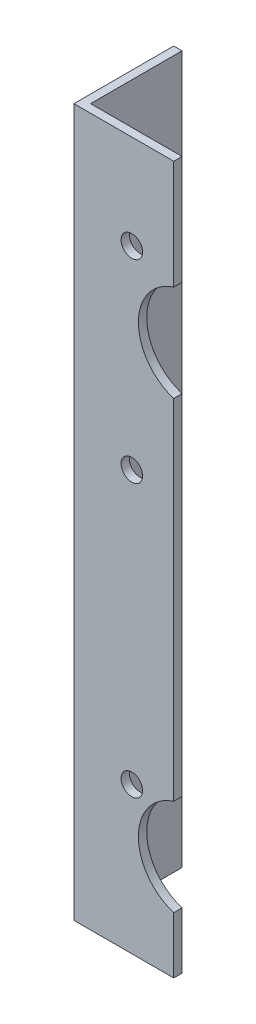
from build123d import *

# Parameters (mm, degrees)
BOSS_EXTRUDE1_DEPTH = 135
SKETCH2_R           = 2.05
CUT_EXTRUDE1_DEPTH  = 138.451232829
SKETCH3_R           = 2.05
CUT_EXTRUDE2_DEPTH  = 138.451232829
SKETCH4_R           = 9.65
CUT_EXTRUDE3_DEPTH  = 10


with BuildPart() as part:
    # Sketch1 → Boss-Extrude1 (new body)
    with BuildSketch(Plane(origin=(0, 0, 0), x_dir=(1, 0, 0), z_dir=(0, 1, 0))):
        Polygon((0, 0), (19.05, 0), (19.05, 1.5875), (1.5875, 1.5875), (1.5875, 19.05), (0, 19.05), align=None)
    extrude(amount=BOSS_EXTRUDE1_DEPTH)

    # Sketch2 → Cut-Extrude1 (cut, through all)
    with BuildSketch(Plane(origin=(1.5875, 0, 0), x_dir=(0, 0, -1), z_dir=(1, 0, 0))):
        with Locations((11.05, 117)):
            Circle(SKETCH2_R)
        with Locations((11.05, 80)):
            Circle(SKETCH2_R)
        with Locations((11.05, 28)):
            Circle(SKETCH2_R)
    extrude(amount=-CUT_EXTRUDE1_DEPTH, mode=Mode.SUBTRACT)

    # Sketch3 → Cut-Extrude2 (cut, through all)
    with BuildSketch(Plane(origin=(0, 0, -1.5875), x_dir=(-1, 0, 0), z_dir=(0, 0, -1))):
        with Locations((-11.05, 117)):
            Circle(SKETCH3_R)
        with Locations((-11.05, 80)):
            Circle(SKETCH3_R)
        with Locations((-11.05, 28)):
            Circle(SKETCH3_R)
    extrude(amount=-CUT_EXTRUDE2_DEPTH, mode=Mode.SUBTRACT)

    # Sketch4 → Cut-Extrude3 (cut)
    with BuildSketch(Plane(origin=(0, 0, -1.5875), x_dir=(-1, 0, 0), z_dir=(0, 0, -1))):
        with Locations((-21.95, 105)):
            Circle(SKETCH4_R)
        with Locations((-21.95, 20)):
            Circle(SKETCH4_R)
    extrude(amount=-CUT_EXTRUDE3_DEPTH, mode=Mode.SUBTRACT)


solid = part.part
